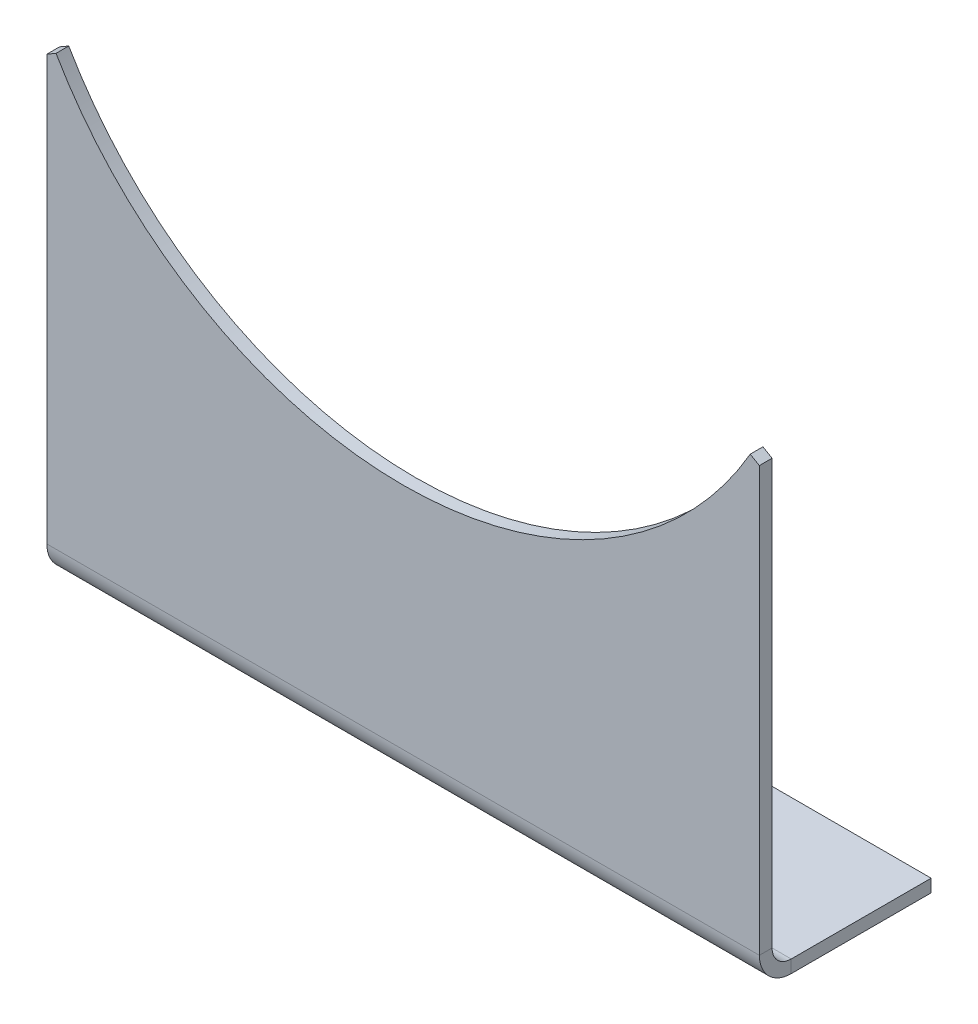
ISO-10303-21;
HEADER;
FILE_DESCRIPTION(('STEP AP214'),'2;1');
FILE_NAME('part.step','',(''),(''),'','','');
FILE_SCHEMA(('AUTOMOTIVE_DESIGN { 1 0 10303 214 1 1 1 1 }'));
ENDSEC;
DATA;
#1=APPLICATION_CONTEXT('core data for automotive mechanical design processes');
#2=APPLICATION_PROTOCOL_DEFINITION('international standard','automotive_design',2000,#1);
#3=PRODUCT_CONTEXT('',#1,'mechanical');
#4=PRODUCT('Part','Part','',(#3));
#5=PRODUCT_RELATED_PRODUCT_CATEGORY('part','',(#4));
#6=PRODUCT_DEFINITION_FORMATION('','',#4);
#7=PRODUCT_DEFINITION_CONTEXT('part definition',#1,'design');
#8=PRODUCT_DEFINITION('design','',#6,#7);
#9=PRODUCT_DEFINITION_SHAPE('','',#8);
#10=(LENGTH_UNIT() NAMED_UNIT(*) SI_UNIT(.MILLI.,.METRE.));
#11=(NAMED_UNIT(*) PLANE_ANGLE_UNIT() SI_UNIT($,.RADIAN.));
#12=(NAMED_UNIT(*) SI_UNIT($,.STERADIAN.) SOLID_ANGLE_UNIT());
#13=UNCERTAINTY_MEASURE_WITH_UNIT(LENGTH_MEASURE(1.E-05),#10,'distance_accuracy_value','');
#14=(GEOMETRIC_REPRESENTATION_CONTEXT(3) GLOBAL_UNCERTAINTY_ASSIGNED_CONTEXT((#13)) GLOBAL_UNIT_ASSIGNED_CONTEXT((#10,
#11,#12)) REPRESENTATION_CONTEXT('',''));
#15=CARTESIAN_POINT('',(0.,0.,0.));
#16=DIRECTION('',(0.,0.,1.));
#17=DIRECTION('',(1.,0.,0.));
#18=AXIS2_PLACEMENT_3D('',#15,#16,#17);
#19=CARTESIAN_POINT('',(280.,-510.,-145.));
#20=DIRECTION('',(-1.,0.,0.));
#21=DIRECTION('',(0.,0.,1.));
#22=AXIS2_PLACEMENT_3D('',#19,#20,#21);
#23=PLANE('',#22);
#24=DIRECTION('',(0.,-1.,0.));
#25=VECTOR('',#24,1.);
#26=CARTESIAN_POINT('',(280.,-510.,-35.));
#27=LINE('',#26,#25);
#28=CARTESIAN_POINT('',(280.,-510.,-35.));
#29=VERTEX_POINT('',#28);
#30=CARTESIAN_POINT('',(280.,-520.,-35.));
#31=VERTEX_POINT('',#30);
#32=EDGE_CURVE('E180',#29,#31,#27,.T.);
#33=ORIENTED_EDGE('',*,*,#32,.T.);
#34=DIRECTION('',(0.,0.,-1.));
#35=VECTOR('',#34,1.);
#36=CARTESIAN_POINT('',(280.,-520.,-145.));
#37=LINE('',#36,#35);
#38=CARTESIAN_POINT('',(280.,-520.,-145.));
#39=VERTEX_POINT('',#38);
#40=EDGE_CURVE('E193',#31,#39,#37,.T.);
#41=ORIENTED_EDGE('',*,*,#40,.T.);
#42=DIRECTION('',(0.,-1.,0.));
#43=VECTOR('',#42,1.);
#44=CARTESIAN_POINT('',(280.,-510.,-145.));
#45=LINE('',#44,#43);
#46=CARTESIAN_POINT('',(280.,-510.,-145.));
#47=VERTEX_POINT('',#46);
#48=EDGE_CURVE('E212',#47,#39,#45,.T.);
#49=ORIENTED_EDGE('',*,*,#48,.F.);
#50=DIRECTION('',(0.,0.,-1.));
#51=VECTOR('',#50,1.);
#52=CARTESIAN_POINT('',(280.,-510.,-145.));
#53=LINE('',#52,#51);
#54=EDGE_CURVE('E196',#29,#47,#53,.T.);
#55=ORIENTED_EDGE('',*,*,#54,.F.);
#56=EDGE_LOOP('',(#33,#41,#49,#55));
#57=FACE_BOUND('',#56,.T.);
#58=ADVANCED_FACE('F54',(#57),#23,.F.);
#59=CARTESIAN_POINT('',(-280.,-510.,-145.));
#60=DIRECTION('',(1.,0.,0.));
#61=DIRECTION('',(0.,0.,-1.));
#62=AXIS2_PLACEMENT_3D('',#59,#60,#61);
#63=PLANE('',#62);
#64=DIRECTION('',(0.,-1.,0.));
#65=VECTOR('',#64,1.);
#66=CARTESIAN_POINT('',(-280.,-510.,-35.));
#67=LINE('',#66,#65);
#68=CARTESIAN_POINT('',(-280.,-510.,-35.));
#69=VERTEX_POINT('',#68);
#70=CARTESIAN_POINT('',(-280.,-520.,-35.));
#71=VERTEX_POINT('',#70);
#72=EDGE_CURVE('E190',#69,#71,#67,.T.);
#73=ORIENTED_EDGE('',*,*,#72,.F.);
#74=DIRECTION('',(0.,0.,1.));
#75=VECTOR('',#74,1.);
#76=CARTESIAN_POINT('',(-280.,-510.,-145.));
#77=LINE('',#76,#75);
#78=CARTESIAN_POINT('',(-280.,-510.,-145.));
#79=VERTEX_POINT('',#78);
#80=EDGE_CURVE('E201',#79,#69,#77,.T.);
#81=ORIENTED_EDGE('',*,*,#80,.F.);
#82=DIRECTION('',(0.,-1.,0.));
#83=VECTOR('',#82,1.);
#84=CARTESIAN_POINT('',(-280.,-510.,-145.));
#85=LINE('',#84,#83);
#86=CARTESIAN_POINT('',(-280.,-520.,-145.));
#87=VERTEX_POINT('',#86);
#88=EDGE_CURVE('E204',#79,#87,#85,.T.);
#89=ORIENTED_EDGE('',*,*,#88,.T.);
#90=DIRECTION('',(0.,0.,1.));
#91=VECTOR('',#90,1.);
#92=CARTESIAN_POINT('',(-280.,-520.,-145.));
#93=LINE('',#92,#91);
#94=EDGE_CURVE('E199',#87,#71,#93,.T.);
#95=ORIENTED_EDGE('',*,*,#94,.T.);
#96=EDGE_LOOP('',(#73,#81,#89,#95));
#97=FACE_BOUND('',#96,.T.);
#98=ADVANCED_FACE('F228',(#97),#63,.F.);
#99=CARTESIAN_POINT('',(280.,-510.,-10.));
#100=DIRECTION('',(0.,-1.,0.));
#101=DIRECTION('',(0.,0.,-1.));
#102=AXIS2_PLACEMENT_3D('',#99,#100,#101);
#103=PLANE('',#102);
#104=CARTESIAN_POINT('',(-210.,-510.,-75.));
#105=DIRECTION('',(0.,1.,0.));
#106=DIRECTION('',(0.,0.,1.));
#107=AXIS2_PLACEMENT_3D('',#104,#105,#106);
#108=CIRCLE('',#107,10.);
#109=CARTESIAN_POINT('',(-210.,-510.,-65.));
#110=VERTEX_POINT('',#109);
#111=EDGE_CURVE('E258',#110,#110,#108,.T.);
#112=ORIENTED_EDGE('',*,*,#111,.F.);
#113=EDGE_LOOP('',(#112));
#114=FACE_BOUND('',#113,.T.);
#115=CARTESIAN_POINT('',(210.,-510.,-75.));
#116=DIRECTION('',(0.,1.,0.));
#117=DIRECTION('',(0.,0.,1.));
#118=AXIS2_PLACEMENT_3D('',#115,#116,#117);
#119=CIRCLE('',#118,10.);
#120=CARTESIAN_POINT('',(210.,-510.,-65.));
#121=VERTEX_POINT('',#120);
#122=EDGE_CURVE('E150',#121,#121,#119,.T.);
#123=ORIENTED_EDGE('',*,*,#122,.F.);
#124=EDGE_LOOP('',(#123));
#125=FACE_BOUND('',#124,.T.);
#126=DIRECTION('',(1.,0.,0.));
#127=VECTOR('',#126,1.);
#128=CARTESIAN_POINT('',(280.,-510.,-35.));
#129=LINE('',#128,#127);
#130=EDGE_CURVE('E186',#29,#69,#129,.F.);
#131=ORIENTED_EDGE('',*,*,#130,.F.);
#132=ORIENTED_EDGE('',*,*,#54,.T.);
#133=DIRECTION('',(-1.,0.,0.));
#134=VECTOR('',#133,1.);
#135=CARTESIAN_POINT('',(280.,-510.,-145.));
#136=LINE('',#135,#134);
#137=EDGE_CURVE('E198',#47,#79,#136,.T.);
#138=ORIENTED_EDGE('',*,*,#137,.T.);
#139=ORIENTED_EDGE('',*,*,#80,.T.);
#140=EDGE_LOOP('',(#131,#132,#138,#139));
#141=FACE_BOUND('',#140,.T.);
#142=ADVANCED_FACE('F232',(#114,#125,#141),#103,.F.);
#143=CARTESIAN_POINT('',(280.,-520.,-10.));
#144=DIRECTION('',(0.,-1.,0.));
#145=DIRECTION('',(0.,0.,-1.));
#146=AXIS2_PLACEMENT_3D('',#143,#144,#145);
#147=PLANE('',#146);
#148=CARTESIAN_POINT('',(-210.,-520.,-75.));
#149=DIRECTION('',(0.,1.,0.));
#150=DIRECTION('',(0.,0.,1.));
#151=AXIS2_PLACEMENT_3D('',#148,#149,#150);
#152=CIRCLE('',#151,10.);
#153=CARTESIAN_POINT('',(-210.,-520.,-65.));
#154=VERTEX_POINT('',#153);
#155=EDGE_CURVE('E261',#154,#154,#152,.T.);
#156=ORIENTED_EDGE('',*,*,#155,.T.);
#157=EDGE_LOOP('',(#156));
#158=FACE_BOUND('',#157,.T.);
#159=CARTESIAN_POINT('',(210.,-520.,-75.));
#160=DIRECTION('',(0.,1.,0.));
#161=DIRECTION('',(0.,0.,1.));
#162=AXIS2_PLACEMENT_3D('',#159,#160,#161);
#163=CIRCLE('',#162,10.);
#164=CARTESIAN_POINT('',(210.,-520.,-65.));
#165=VERTEX_POINT('',#164);
#166=EDGE_CURVE('E145',#165,#165,#163,.T.);
#167=ORIENTED_EDGE('',*,*,#166,.T.);
#168=EDGE_LOOP('',(#167));
#169=FACE_BOUND('',#168,.T.);
#170=ORIENTED_EDGE('',*,*,#40,.F.);
#171=DIRECTION('',(1.,0.,0.));
#172=VECTOR('',#171,1.);
#173=CARTESIAN_POINT('',(280.,-520.,-35.));
#174=LINE('',#173,#172);
#175=EDGE_CURVE('E173',#31,#71,#174,.F.);
#176=ORIENTED_EDGE('',*,*,#175,.T.);
#177=ORIENTED_EDGE('',*,*,#94,.F.);
#178=DIRECTION('',(-1.,0.,0.));
#179=VECTOR('',#178,1.);
#180=CARTESIAN_POINT('',(280.,-520.,-145.));
#181=LINE('',#180,#179);
#182=EDGE_CURVE('E206',#39,#87,#181,.T.);
#183=ORIENTED_EDGE('',*,*,#182,.F.);
#184=EDGE_LOOP('',(#170,#176,#177,#183));
#185=FACE_BOUND('',#184,.T.);
#186=ADVANCED_FACE('F225',(#158,#169,#185),#147,.T.);
#187=CARTESIAN_POINT('',(280.,-510.,-145.));
#188=DIRECTION('',(0.,0.,1.));
#189=DIRECTION('',(1.,0.,0.));
#190=AXIS2_PLACEMENT_3D('',#187,#188,#189);
#191=PLANE('',#190);
#192=ORIENTED_EDGE('',*,*,#182,.T.);
#193=ORIENTED_EDGE('',*,*,#88,.F.);
#194=ORIENTED_EDGE('',*,*,#137,.F.);
#195=ORIENTED_EDGE('',*,*,#48,.T.);
#196=EDGE_LOOP('',(#192,#193,#194,#195));
#197=FACE_BOUND('',#196,.T.);
#198=ADVANCED_FACE('F217',(#197),#191,.F.);
#199=CARTESIAN_POINT('',(-280.,-495.,-35.));
#200=DIRECTION('',(-1.,0.,0.));
#201=DIRECTION('',(0.,0.,1.));
#202=AXIS2_PLACEMENT_3D('',#199,#200,#201);
#203=PLANE('',#202);
#204=DIRECTION('',(0.,0.,-1.));
#205=VECTOR('',#204,1.);
#206=CARTESIAN_POINT('',(-280.,-495.,-10.));
#207=LINE('',#206,#205);
#208=CARTESIAN_POINT('',(-280.,-495.,-20.));
#209=VERTEX_POINT('',#208);
#210=CARTESIAN_POINT('',(-280.,-495.,-10.));
#211=VERTEX_POINT('',#210);
#212=EDGE_CURVE('E147',#209,#211,#207,.F.);
#213=ORIENTED_EDGE('',*,*,#212,.F.);
#214=CARTESIAN_POINT('',(-280.,-495.,-35.));
#215=DIRECTION('',(1.,0.,0.));
#216=DIRECTION('',(0.,0.,-1.));
#217=AXIS2_PLACEMENT_3D('',#214,#215,#216);
#218=CIRCLE('',#217,15.);
#219=EDGE_CURVE('E183',#69,#209,#218,.F.);
#220=ORIENTED_EDGE('',*,*,#219,.F.);
#221=ORIENTED_EDGE('',*,*,#72,.T.);
#222=CARTESIAN_POINT('',(-280.,-495.,-35.));
#223=DIRECTION('',(1.,0.,0.));
#224=DIRECTION('',(0.,0.,-1.));
#225=AXIS2_PLACEMENT_3D('',#222,#223,#224);
#226=CIRCLE('',#225,25.);
#227=EDGE_CURVE('E176',#71,#211,#226,.F.);
#228=ORIENTED_EDGE('',*,*,#227,.T.);
#229=EDGE_LOOP('',(#213,#220,#221,#228));
#230=FACE_BOUND('',#229,.T.);
#231=ADVANCED_FACE('F240',(#230),#203,.T.);
#232=CARTESIAN_POINT('',(280.,-495.,-35.));
#233=DIRECTION('',(-1.,0.,0.));
#234=DIRECTION('',(0.,0.,1.));
#235=AXIS2_PLACEMENT_3D('',#232,#233,#234);
#236=PLANE('',#235);
#237=CARTESIAN_POINT('',(280.,-495.,-35.));
#238=DIRECTION('',(1.,0.,0.));
#239=DIRECTION('',(0.,0.,-1.));
#240=AXIS2_PLACEMENT_3D('',#237,#238,#239);
#241=CIRCLE('',#240,15.);
#242=CARTESIAN_POINT('',(280.,-495.,-20.));
#243=VERTEX_POINT('',#242);
#244=EDGE_CURVE('E156',#243,#29,#241,.T.);
#245=ORIENTED_EDGE('',*,*,#244,.F.);
#246=DIRECTION('',(0.,0.,-1.));
#247=VECTOR('',#246,1.);
#248=CARTESIAN_POINT('',(280.,-495.,-19.9999999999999));
#249=LINE('',#248,#247);
#250=CARTESIAN_POINT('',(280.,-495.,-10.));
#251=VERTEX_POINT('',#250);
#252=EDGE_CURVE('E166',#243,#251,#249,.F.);
#253=ORIENTED_EDGE('',*,*,#252,.T.);
#254=CARTESIAN_POINT('',(280.,-495.,-35.));
#255=DIRECTION('',(1.,0.,0.));
#256=DIRECTION('',(0.,0.,-1.));
#257=AXIS2_PLACEMENT_3D('',#254,#255,#256);
#258=CIRCLE('',#257,25.);
#259=EDGE_CURVE('E177',#251,#31,#258,.T.);
#260=ORIENTED_EDGE('',*,*,#259,.T.);
#261=ORIENTED_EDGE('',*,*,#32,.F.);
#262=EDGE_LOOP('',(#245,#253,#260,#261));
#263=FACE_BOUND('',#262,.T.);
#264=ADVANCED_FACE('F254',(#263),#236,.F.);
#265=CARTESIAN_POINT('',(280.,-495.,-35.));
#266=DIRECTION('',(1.,0.,0.));
#267=DIRECTION('',(0.,0.,1.));
#268=AXIS2_PLACEMENT_3D('',#265,#266,#267);
#269=CYLINDRICAL_SURFACE('',#268,25.);
#270=ORIENTED_EDGE('',*,*,#175,.F.);
#271=ORIENTED_EDGE('',*,*,#259,.F.);
#272=DIRECTION('',(1.,0.,0.));
#273=VECTOR('',#272,1.);
#274=CARTESIAN_POINT('',(-280.,-495.,-10.));
#275=LINE('',#274,#273);
#276=EDGE_CURVE('E163',#251,#211,#275,.F.);
#277=ORIENTED_EDGE('',*,*,#276,.T.);
#278=ORIENTED_EDGE('',*,*,#227,.F.);
#279=EDGE_LOOP('',(#270,#271,#277,#278));
#280=FACE_BOUND('',#279,.T.);
#281=ADVANCED_FACE('F303',(#280),#269,.T.);
#282=CARTESIAN_POINT('',(280.,-495.,-35.));
#283=DIRECTION('',(1.,0.,0.));
#284=DIRECTION('',(0.,0.,1.));
#285=AXIS2_PLACEMENT_3D('',#282,#283,#284);
#286=CYLINDRICAL_SURFACE('',#285,15.);
#287=ORIENTED_EDGE('',*,*,#130,.T.);
#288=ORIENTED_EDGE('',*,*,#219,.T.);
#289=DIRECTION('',(1.,0.,0.));
#290=VECTOR('',#289,1.);
#291=CARTESIAN_POINT('',(-280.,-495.,-20.));
#292=LINE('',#291,#290);
#293=EDGE_CURVE('E169',#209,#243,#292,.T.);
#294=ORIENTED_EDGE('',*,*,#293,.T.);
#295=ORIENTED_EDGE('',*,*,#244,.T.);
#296=EDGE_LOOP('',(#287,#288,#294,#295));
#297=FACE_BOUND('',#296,.T.);
#298=ADVANCED_FACE('F235',(#297),#286,.F.);
#299=CARTESIAN_POINT('',(280.,-421.,-10.));
#300=DIRECTION('',(-1.,0.,0.));
#301=DIRECTION('',(0.,0.,1.));
#302=AXIS2_PLACEMENT_3D('',#299,#300,#301);
#303=PLANE('',#302);
#304=DIRECTION('',(0.,-1.,0.));
#305=VECTOR('',#304,1.);
#306=CARTESIAN_POINT('',(280.,-421.,-20.));
#307=LINE('',#306,#305);
#308=CARTESIAN_POINT('',(280.,-161.658075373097,-20.));
#309=VERTEX_POINT('',#308);
#310=EDGE_CURVE('E160',#243,#309,#307,.F.);
#311=ORIENTED_EDGE('',*,*,#310,.T.);
#312=DIRECTION('',(0.,0.,1.));
#313=VECTOR('',#312,1.);
#314=CARTESIAN_POINT('',(280.,-161.658075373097,-10.));
#315=LINE('',#314,#313);
#316=CARTESIAN_POINT('',(280.,-161.658075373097,-10.));
#317=VERTEX_POINT('',#316);
#318=EDGE_CURVE('E257',#309,#317,#315,.T.);
#319=ORIENTED_EDGE('',*,*,#318,.T.);
#320=DIRECTION('',(0.,1.,0.));
#321=VECTOR('',#320,1.);
#322=CARTESIAN_POINT('',(280.,-510.,-10.));
#323=LINE('',#322,#321);
#324=EDGE_CURVE('E141',#251,#317,#323,.T.);
#325=ORIENTED_EDGE('',*,*,#324,.F.);
#326=ORIENTED_EDGE('',*,*,#252,.F.);
#327=EDGE_LOOP('',(#311,#319,#325,#326));
#328=FACE_BOUND('',#327,.T.);
#329=ADVANCED_FACE('F256',(#328),#303,.F.);
#330=CARTESIAN_POINT('',(-280.,-510.,-10.));
#331=DIRECTION('',(1.,0.,0.));
#332=DIRECTION('',(0.,0.,-1.));
#333=AXIS2_PLACEMENT_3D('',#330,#331,#332);
#334=PLANE('',#333);
#335=DIRECTION('',(0.,-1.,0.));
#336=VECTOR('',#335,1.);
#337=CARTESIAN_POINT('',(-280.,-510.,-10.));
#338=LINE('',#337,#336);
#339=CARTESIAN_POINT('',(-280.,-161.658075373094,-10.));
#340=VERTEX_POINT('',#339);
#341=EDGE_CURVE('E154',#340,#211,#338,.T.);
#342=ORIENTED_EDGE('',*,*,#341,.F.);
#343=DIRECTION('',(0.,0.,-1.));
#344=VECTOR('',#343,1.);
#345=CARTESIAN_POINT('',(-280.,-161.658075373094,-10.));
#346=LINE('',#345,#344);
#347=CARTESIAN_POINT('',(-280.,-161.658075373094,-20.));
#348=VERTEX_POINT('',#347);
#349=EDGE_CURVE('E246',#340,#348,#346,.T.);
#350=ORIENTED_EDGE('',*,*,#349,.T.);
#351=DIRECTION('',(0.,1.,0.));
#352=VECTOR('',#351,1.);
#353=CARTESIAN_POINT('',(-280.,-510.,-20.));
#354=LINE('',#353,#352);
#355=EDGE_CURVE('E158',#348,#209,#354,.F.);
#356=ORIENTED_EDGE('',*,*,#355,.T.);
#357=ORIENTED_EDGE('',*,*,#212,.T.);
#358=EDGE_LOOP('',(#342,#350,#356,#357));
#359=FACE_BOUND('',#358,.T.);
#360=ADVANCED_FACE('F243',(#359),#334,.F.);
#361=CARTESIAN_POINT('',(280.,-510.,-10.));
#362=DIRECTION('',(0.,0.,-1.));
#363=DIRECTION('',(-1.,0.,0.));
#364=AXIS2_PLACEMENT_3D('',#361,#362,#363);
#365=PLANE('',#364);
#366=ORIENTED_EDGE('',*,*,#324,.T.);
#367=DIRECTION('',(0.866025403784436,-0.500000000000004,0.));
#368=VECTOR('',#367,1.);
#369=CARTESIAN_POINT('',(749.999999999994,-433.012701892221,-10.));
#370=LINE('',#369,#368);
#371=CARTESIAN_POINT('',(272.798002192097,-157.500000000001,-10.));
#372=VERTEX_POINT('',#371);
#373=EDGE_CURVE('E128',#372,#317,#370,.T.);
#374=ORIENTED_EDGE('',*,*,#373,.F.);
#375=CARTESIAN_POINT('',(0.,0.,-10.));
#376=DIRECTION('',(0.,0.,-1.));
#377=DIRECTION('',(-1.,0.,0.));
#378=AXIS2_PLACEMENT_3D('',#375,#376,#377);
#379=CIRCLE('',#378,315.);
#380=CARTESIAN_POINT('',(-272.798002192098,-157.499999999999,-10.));
#381=VERTEX_POINT('',#380);
#382=EDGE_CURVE('E138',#372,#381,#379,.T.);
#383=ORIENTED_EDGE('',*,*,#382,.T.);
#384=DIRECTION('',(0.86602540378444,0.499999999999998,0.));
#385=VECTOR('',#384,1.);
#386=CARTESIAN_POINT('',(0.,0.,-10.));
#387=LINE('',#386,#385);
#388=EDGE_CURVE('E68',#340,#381,#387,.T.);
#389=ORIENTED_EDGE('',*,*,#388,.F.);
#390=ORIENTED_EDGE('',*,*,#341,.T.);
#391=ORIENTED_EDGE('',*,*,#276,.F.);
#392=EDGE_LOOP('',(#366,#374,#383,#389,#390,#391));
#393=FACE_BOUND('',#392,.T.);
#394=ADVANCED_FACE('F137',(#393),#365,.F.);
#395=CARTESIAN_POINT('',(280.,-510.,-20.));
#396=DIRECTION('',(0.,0.,-1.));
#397=DIRECTION('',(-1.,0.,0.));
#398=AXIS2_PLACEMENT_3D('',#395,#396,#397);
#399=PLANE('',#398);
#400=DIRECTION('',(0.866025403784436,-0.500000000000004,0.));
#401=VECTOR('',#400,1.);
#402=CARTESIAN_POINT('',(749.999999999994,-433.012701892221,-20.));
#403=LINE('',#402,#401);
#404=CARTESIAN_POINT('',(272.798002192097,-157.500000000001,-20.));
#405=VERTEX_POINT('',#404);
#406=EDGE_CURVE('E76',#405,#309,#403,.T.);
#407=ORIENTED_EDGE('',*,*,#406,.T.);
#408=ORIENTED_EDGE('',*,*,#310,.F.);
#409=ORIENTED_EDGE('',*,*,#293,.F.);
#410=ORIENTED_EDGE('',*,*,#355,.F.);
#411=DIRECTION('',(0.86602540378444,0.499999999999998,0.));
#412=VECTOR('',#411,1.);
#413=CARTESIAN_POINT('',(0.,0.,-20.));
#414=LINE('',#413,#412);
#415=CARTESIAN_POINT('',(-272.798002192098,-157.499999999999,-20.));
#416=VERTEX_POINT('',#415);
#417=EDGE_CURVE('E250',#348,#416,#414,.T.);
#418=ORIENTED_EDGE('',*,*,#417,.T.);
#419=CARTESIAN_POINT('',(0.,0.,-20.));
#420=DIRECTION('',(0.,0.,1.));
#421=DIRECTION('',(1.,0.,0.));
#422=AXIS2_PLACEMENT_3D('',#419,#420,#421);
#423=CIRCLE('',#422,315.);
#424=EDGE_CURVE('E144',#416,#405,#423,.T.);
#425=ORIENTED_EDGE('',*,*,#424,.T.);
#426=EDGE_LOOP('',(#407,#408,#409,#410,#418,#425));
#427=FACE_BOUND('',#426,.T.);
#428=ADVANCED_FACE('F249',(#427),#399,.T.);
#429=CARTESIAN_POINT('',(0.,0.,-155.));
#430=DIRECTION('',(0.,0.,1.));
#431=DIRECTION('',(1.,0.,0.));
#432=AXIS2_PLACEMENT_3D('',#429,#430,#431);
#433=CYLINDRICAL_SURFACE('',#432,315.);
#434=ORIENTED_EDGE('',*,*,#382,.F.);
#435=DIRECTION('',(0.,0.,1.));
#436=VECTOR('',#435,1.);
#437=CARTESIAN_POINT('',(272.798002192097,-157.500000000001,-155.));
#438=LINE('',#437,#436);
#439=EDGE_CURVE('E13',#372,#405,#438,.F.);
#440=ORIENTED_EDGE('',*,*,#439,.T.);
#441=ORIENTED_EDGE('',*,*,#424,.F.);
#442=DIRECTION('',(0.,0.,1.));
#443=VECTOR('',#442,1.);
#444=CARTESIAN_POINT('',(-272.798002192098,-157.499999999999,-155.));
#445=LINE('',#444,#443);
#446=EDGE_CURVE('E61',#416,#381,#445,.T.);
#447=ORIENTED_EDGE('',*,*,#446,.T.);
#448=EDGE_LOOP('',(#434,#440,#441,#447));
#449=FACE_BOUND('',#448,.T.);
#450=ADVANCED_FACE('F143',(#449),#433,.F.);
#451=CARTESIAN_POINT('',(210.,-520.,-75.));
#452=DIRECTION('',(0.,1.,0.));
#453=DIRECTION('',(0.,0.,1.));
#454=AXIS2_PLACEMENT_3D('',#451,#452,#453);
#455=CYLINDRICAL_SURFACE('',#454,10.);
#456=ORIENTED_EDGE('',*,*,#166,.F.);
#457=EDGE_LOOP('',(#456));
#458=FACE_BOUND('',#457,.T.);
#459=ORIENTED_EDGE('',*,*,#122,.T.);
#460=EDGE_LOOP('',(#459));
#461=FACE_BOUND('',#460,.T.);
#462=ADVANCED_FACE('F270',(#458,#461),#455,.F.);
#463=CARTESIAN_POINT('',(-210.,-520.,-75.));
#464=DIRECTION('',(0.,1.,0.));
#465=DIRECTION('',(0.,0.,1.));
#466=AXIS2_PLACEMENT_3D('',#463,#464,#465);
#467=CYLINDRICAL_SURFACE('',#466,10.);
#468=ORIENTED_EDGE('',*,*,#155,.F.);
#469=EDGE_LOOP('',(#468));
#470=FACE_BOUND('',#469,.T.);
#471=ORIENTED_EDGE('',*,*,#111,.T.);
#472=EDGE_LOOP('',(#471));
#473=FACE_BOUND('',#472,.T.);
#474=ADVANCED_FACE('F353',(#470,#473),#467,.F.);
#475=CARTESIAN_POINT('',(0.,0.,-20.));
#476=DIRECTION('',(0.499999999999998,-0.86602540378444,0.));
#477=DIRECTION('',(0.86602540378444,0.499999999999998,0.));
#478=AXIS2_PLACEMENT_3D('',#475,#476,#477);
#479=PLANE('',#478);
#480=ORIENTED_EDGE('',*,*,#388,.T.);
#481=ORIENTED_EDGE('',*,*,#446,.F.);
#482=ORIENTED_EDGE('',*,*,#417,.F.);
#483=ORIENTED_EDGE('',*,*,#349,.F.);
#484=EDGE_LOOP('',(#480,#481,#482,#483));
#485=FACE_BOUND('',#484,.T.);
#486=ADVANCED_FACE('F365',(#485),#479,.F.);
#487=CARTESIAN_POINT('',(749.999999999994,-433.012701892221,-20.));
#488=DIRECTION('',(-0.500000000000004,-0.866025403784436,0.));
#489=DIRECTION('',(0.866025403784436,-0.500000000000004,0.));
#490=AXIS2_PLACEMENT_3D('',#487,#488,#489);
#491=PLANE('',#490);
#492=ORIENTED_EDGE('',*,*,#406,.F.);
#493=ORIENTED_EDGE('',*,*,#439,.F.);
#494=ORIENTED_EDGE('',*,*,#373,.T.);
#495=ORIENTED_EDGE('',*,*,#318,.F.);
#496=EDGE_LOOP('',(#492,#493,#494,#495));
#497=FACE_BOUND('',#496,.T.);
#498=ADVANCED_FACE('F127',(#497),#491,.F.);
#499=CLOSED_SHELL('',(#58,#98,#142,#186,#198,#231,#264,#281,#298,#329,#360,#394,#428,#450,#462,
#474,#486,#498));
#500=MANIFOLD_SOLID_BREP('B2',#499);
#501=ADVANCED_BREP_SHAPE_REPRESENTATION('',(#18,#500),#14);
#502=SHAPE_DEFINITION_REPRESENTATION(#9,#501);
ENDSEC;
END-ISO-10303-21;
